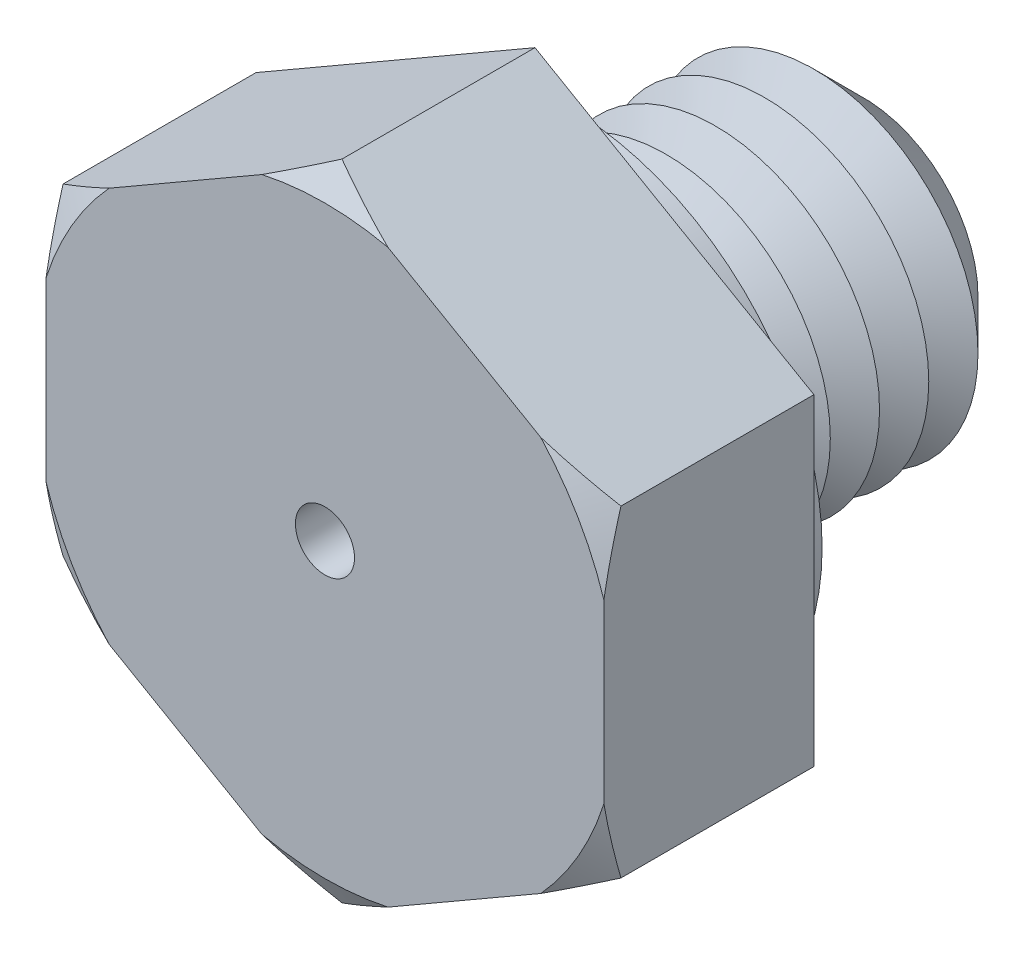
from build123d import *

# Parameters (mm, degrees)
BOSS_EXTRUDE1_DEPTH = 6.4
SKETCH3_R           = 5
BOSS_EXTRUDE2_DEPTH = 10
SKETCH4_R           = 7.75
BOSS_EXTRUDE3_DEPTH = 1
CHAMFER1_SIZE       = 1.5
LPATTERN1_COUNT     = 5
LPATTERN1_PITCH     = 1.5
SKETCH8_R           = 0.9
CUT_EXTRUDE1_DEPTH  = 16.4


with BuildPart() as part:
    # Sketch2 → Boss-Extrude1 (new body)
    with BuildSketch(Plane.XY):
        Polygon((0, 9.814954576), (-8.5, 4.907477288), (-8.5, -4.907477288), (0, -9.814954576), (8.5, -4.907477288), (8.5, 4.907477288), align=None)
    extrude(amount=BOSS_EXTRUDE1_DEPTH)

    # Sketch3 → Boss-Extrude2 (add)
    with BuildSketch(Plane(origin=(0, 0, 0), x_dir=(-1, 0, 0), z_dir=(0, 0, -1))):
        Circle(SKETCH3_R)
    extrude(amount=BOSS_EXTRUDE2_DEPTH)

    # Sketch4 → Boss-Extrude3 (add)
    with BuildSketch(Plane(origin=(0, 0, 0), x_dir=(-1, 0, 0), z_dir=(0, 0, -1))):
        with Locations(Location((0, 0, 0), (0, 0, 180))):
            Circle(SKETCH4_R)
    extrude(amount=BOSS_EXTRUDE3_DEPTH)

    # Chamfer1
    chamfer1_edges = [part.edges().sort_by_distance(p)[0] for p in [
        (5, 0, -10),
    ]]
    chamfer(chamfer1_edges, length=CHAMFER1_SIZE)

    # Sketch6 → Cut-Revolve1 (revolve, cut)
    with BuildSketch(Plane(origin=(0, 0, 0), x_dir=(0, 0, -1), z_dir=(1, 0, 0)), mode=Mode.PRIVATE) as cut_revolve1_sk:
        Polygon((1, 5), (1.75, 3.700961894), (2.5, 5), align=None)
    cut_revolve1 = revolve(cut_revolve1_sk.sketch.rotate(Axis((0, 0, 3.211670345), (0, 0, -1)), 90), axis=Axis((0, 0, 3.211670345), (0, 0, -1)), mode=Mode.SUBTRACT)

    # LPattern1: Cut-Revolve1 ×5
    with Locations(*[(0, 0, -i * LPATTERN1_PITCH) for i in range(1, LPATTERN1_COUNT)]):
        add(cut_revolve1, mode=Mode.SUBTRACT)

    # Sketch7 → Cut-Revolve2 (revolve, cut)
    with BuildSketch(Plane(origin=(0, 0, 0), x_dir=(0, 0, -1), z_dir=(1, 0, 0)), mode=Mode.PRIVATE) as cut_revolve2_sk:
        Polygon((-6.4, 9.814954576), (-6.4, 8.914954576), (-5.880384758, 9.814954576), align=None)
    revolve(cut_revolve2_sk.sketch.rotate(Axis((0, 0, 3.211670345), (0, 0, -1)), 90), axis=Axis((0, 0, 3.211670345), (0, 0, -1)), mode=Mode.SUBTRACT)

    # Sketch8 → Cut-Extrude1 (cut)
    with BuildSketch(Plane.XY.offset(6.4)):
        Circle(SKETCH8_R)
    extrude(amount=-CUT_EXTRUDE1_DEPTH, mode=Mode.SUBTRACT)


solid = part.part
